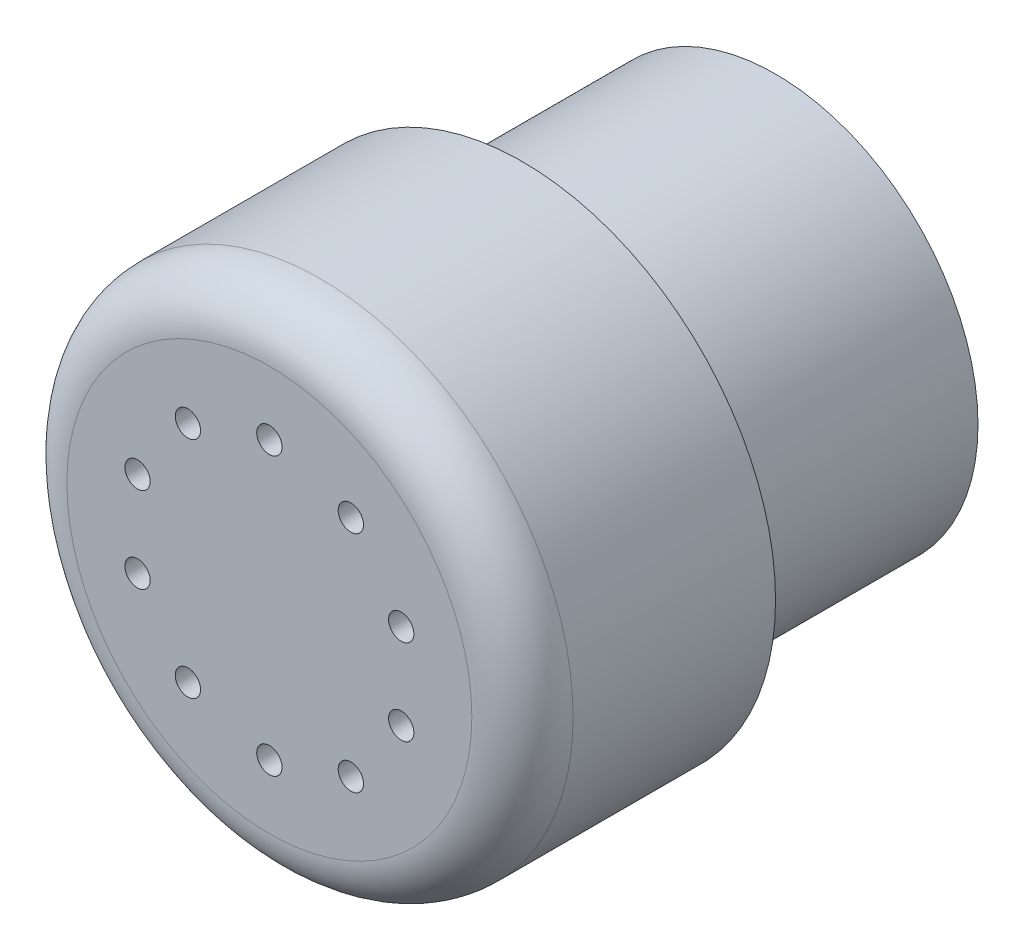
from build123d import *

# Parameters (mm, degrees)
SKETCH_1_R          = 10
EXTRUDE_1_DEPTH     = 10
SKETCH_2_R          = 8
EXTRUDE_2_DEPTH     = 10
FILLET_1_R          = 2
SKETCH_3_R          = 0.5
CUT_EXTRUDE_1_DEPTH = 1


with BuildPart() as part:
    # Sketch 1 → Extrude 1 (new body)
    with BuildSketch(Plane.XY):
        Circle(SKETCH_1_R)
    extrude(amount=EXTRUDE_1_DEPTH)

    # Sketch 2 → Extrude 2 (add)
    with BuildSketch(Plane(origin=(0, 0, 0), x_dir=(-1, 0, 0), z_dir=(0, 0, -1))):
        with Locations(Location((0, 0, 0), (0, 0, 180))):
            Circle(SKETCH_2_R)
    extrude(amount=EXTRUDE_2_DEPTH)

    # Fillet 1
    fillet_1_edges = [part.edges().sort_by_distance(p)[0] for p in [
        (-10, 0, 10),
    ]]
    fillet(fillet_1_edges, radius=FILLET_1_R)

    # Sketch 3 → Cut-Extrude 1 (cut)
    with BuildSketch(Plane.XY.offset(10)):
        with Locations((0, 5.477848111)):
            Circle(SKETCH_3_R)
        with Locations((3.219798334, 4.431672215)):
            Circle(SKETCH_3_R)
        with Locations((5.209743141, 1.692748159)):
            Circle(SKETCH_3_R)
        with Locations((5.209743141, -1.692748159)):
            Circle(SKETCH_3_R)
        with Locations((3.219798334, -4.431672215)):
            Circle(SKETCH_3_R)
        with Locations((0, -5.477848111)):
            Circle(SKETCH_3_R)
        with Locations((-3.219798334, -4.431672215)):
            Circle(SKETCH_3_R)
        with Locations((-5.209743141, -1.692748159)):
            Circle(SKETCH_3_R)
        with Locations((-5.209743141, 1.692748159)):
            Circle(SKETCH_3_R)
        with Locations((-3.219798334, 4.431672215)):
            Circle(SKETCH_3_R)
    extrude(amount=-CUT_EXTRUDE_1_DEPTH, mode=Mode.SUBTRACT)


solid = part.part
